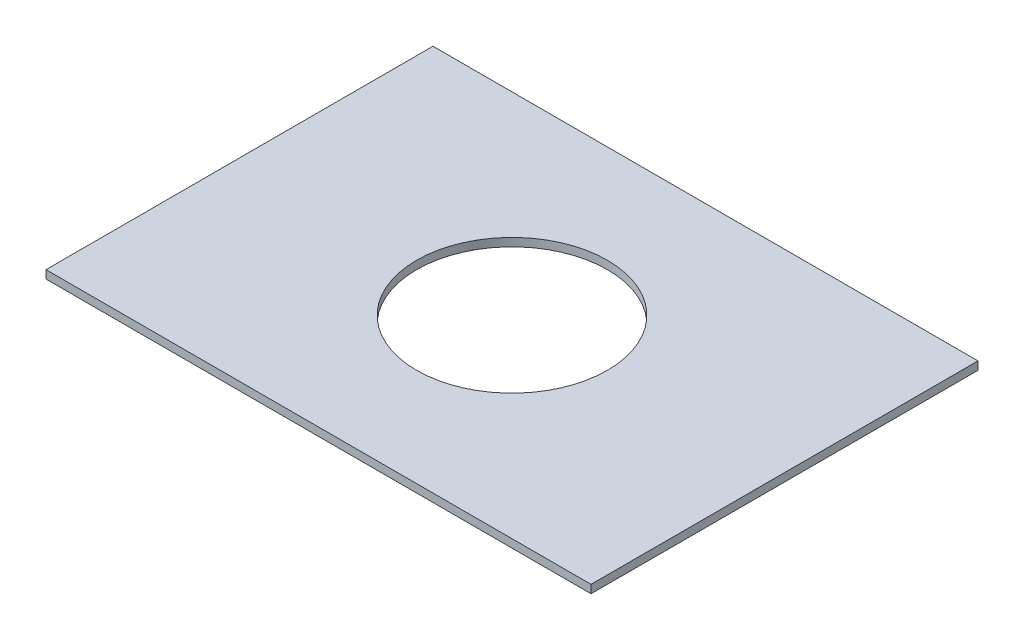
ISO-10303-21;
HEADER;
FILE_DESCRIPTION(('STEP AP214'),'2;1');
FILE_NAME('part.step','',(''),(''),'','','');
FILE_SCHEMA(('AUTOMOTIVE_DESIGN { 1 0 10303 214 1 1 1 1 }'));
ENDSEC;
DATA;
#1=APPLICATION_CONTEXT('core data for automotive mechanical design processes');
#2=APPLICATION_PROTOCOL_DEFINITION('international standard','automotive_design',2000,#1);
#3=PRODUCT_CONTEXT('',#1,'mechanical');
#4=PRODUCT('Part','Part','',(#3));
#5=PRODUCT_RELATED_PRODUCT_CATEGORY('part','',(#4));
#6=PRODUCT_DEFINITION_FORMATION('','',#4);
#7=PRODUCT_DEFINITION_CONTEXT('part definition',#1,'design');
#8=PRODUCT_DEFINITION('design','',#6,#7);
#9=PRODUCT_DEFINITION_SHAPE('','',#8);
#10=(LENGTH_UNIT() NAMED_UNIT(*) SI_UNIT(.MILLI.,.METRE.));
#11=(NAMED_UNIT(*) PLANE_ANGLE_UNIT() SI_UNIT($,.RADIAN.));
#12=(NAMED_UNIT(*) SI_UNIT($,.STERADIAN.) SOLID_ANGLE_UNIT());
#13=UNCERTAINTY_MEASURE_WITH_UNIT(LENGTH_MEASURE(1.E-05),#10,'distance_accuracy_value','');
#14=(GEOMETRIC_REPRESENTATION_CONTEXT(3) GLOBAL_UNCERTAINTY_ASSIGNED_CONTEXT((#13)) GLOBAL_UNIT_ASSIGNED_CONTEXT((#10,
#11,#12)) REPRESENTATION_CONTEXT('',''));
#15=CARTESIAN_POINT('',(0.,0.,0.));
#16=DIRECTION('',(0.,0.,1.));
#17=DIRECTION('',(1.,0.,0.));
#18=AXIS2_PLACEMENT_3D('',#15,#16,#17);
#19=CARTESIAN_POINT('',(0.,0.,0.));
#20=DIRECTION('',(0.,-1.,0.));
#21=DIRECTION('',(0.,0.,-1.));
#22=AXIS2_PLACEMENT_3D('',#19,#20,#21);
#23=PLANE('',#22);
#24=CARTESIAN_POINT('',(51.5,0.,-37.));
#25=DIRECTION('',(0.,-1.,0.));
#26=DIRECTION('',(0.,0.,-1.));
#27=AXIS2_PLACEMENT_3D('',#24,#25,#26);
#28=CIRCLE('',#27,17.5);
#29=CARTESIAN_POINT('',(51.5,0.,-54.5));
#30=VERTEX_POINT('',#29);
#31=EDGE_CURVE('E76',#30,#30,#28,.T.);
#32=ORIENTED_EDGE('',*,*,#31,.F.);
#33=EDGE_LOOP('',(#32));
#34=FACE_BOUND('',#33,.T.);
#35=DIRECTION('',(-1.,0.,0.));
#36=VECTOR('',#35,1.);
#37=CARTESIAN_POINT('',(0.,0.,-72.5));
#38=LINE('',#37,#36);
#39=CARTESIAN_POINT('',(101.5,0.,-72.5));
#40=VERTEX_POINT('',#39);
#41=CARTESIAN_POINT('',(1.5,0.,-72.5));
#42=VERTEX_POINT('',#41);
#43=EDGE_CURVE('E84',#40,#42,#38,.T.);
#44=ORIENTED_EDGE('',*,*,#43,.F.);
#45=DIRECTION('',(0.,0.,1.));
#46=VECTOR('',#45,1.);
#47=CARTESIAN_POINT('',(101.5,0.,0.));
#48=LINE('',#47,#46);
#49=CARTESIAN_POINT('',(101.5,0.,-1.5));
#50=VERTEX_POINT('',#49);
#51=EDGE_CURVE('E11',#40,#50,#48,.T.);
#52=ORIENTED_EDGE('',*,*,#51,.T.);
#53=DIRECTION('',(-1.,0.,0.));
#54=VECTOR('',#53,1.);
#55=CARTESIAN_POINT('',(0.,0.,-1.5));
#56=LINE('',#55,#54);
#57=CARTESIAN_POINT('',(1.50000000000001,0.,-1.5));
#58=VERTEX_POINT('',#57);
#59=EDGE_CURVE('E40',#50,#58,#56,.T.);
#60=ORIENTED_EDGE('',*,*,#59,.T.);
#61=DIRECTION('',(0.,0.,-1.));
#62=VECTOR('',#61,1.);
#63=CARTESIAN_POINT('',(1.50000000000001,0.,0.));
#64=LINE('',#63,#62);
#65=EDGE_CURVE('E96',#58,#42,#64,.T.);
#66=ORIENTED_EDGE('',*,*,#65,.T.);
#67=EDGE_LOOP('',(#44,#52,#60,#66));
#68=FACE_BOUND('',#67,.T.);
#69=ADVANCED_FACE('F33',(#34,#68),#23,.T.);
#70=CARTESIAN_POINT('',(101.5,-8.5,-1.5));
#71=DIRECTION('',(1.,0.,0.));
#72=DIRECTION('',(0.,0.,-1.));
#73=AXIS2_PLACEMENT_3D('',#70,#71,#72);
#74=PLANE('',#73);
#75=DIRECTION('',(0.,1.,0.));
#76=VECTOR('',#75,1.);
#77=CARTESIAN_POINT('',(101.5,-8.5,-72.5));
#78=LINE('',#77,#76);
#79=CARTESIAN_POINT('',(101.5,1.5,-72.5));
#80=VERTEX_POINT('',#79);
#81=EDGE_CURVE('E73',#40,#80,#78,.T.);
#82=ORIENTED_EDGE('',*,*,#81,.T.);
#83=DIRECTION('',(0.,0.,-1.));
#84=VECTOR('',#83,1.);
#85=CARTESIAN_POINT('',(101.5,1.5,-1.5));
#86=LINE('',#85,#84);
#87=CARTESIAN_POINT('',(101.5,1.5,-1.5));
#88=VERTEX_POINT('',#87);
#89=EDGE_CURVE('E83',#88,#80,#86,.T.);
#90=ORIENTED_EDGE('',*,*,#89,.F.);
#91=DIRECTION('',(0.,1.,0.));
#92=VECTOR('',#91,1.);
#93=CARTESIAN_POINT('',(101.5,-8.5,-1.5));
#94=LINE('',#93,#92);
#95=EDGE_CURVE('E91',#50,#88,#94,.T.);
#96=ORIENTED_EDGE('',*,*,#95,.F.);
#97=ORIENTED_EDGE('',*,*,#51,.F.);
#98=EDGE_LOOP('',(#82,#90,#96,#97));
#99=FACE_BOUND('',#98,.T.);
#100=ADVANCED_FACE('F81',(#99),#74,.T.);
#101=CARTESIAN_POINT('',(1.50000000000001,-8.5,-1.5));
#102=DIRECTION('',(0.,0.,1.));
#103=DIRECTION('',(1.,0.,0.));
#104=AXIS2_PLACEMENT_3D('',#101,#102,#103);
#105=PLANE('',#104);
#106=ORIENTED_EDGE('',*,*,#95,.T.);
#107=DIRECTION('',(1.,0.,0.));
#108=VECTOR('',#107,1.);
#109=CARTESIAN_POINT('',(1.50000000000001,1.5,-1.5));
#110=LINE('',#109,#108);
#111=CARTESIAN_POINT('',(1.50000000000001,1.5,-1.5));
#112=VERTEX_POINT('',#111);
#113=EDGE_CURVE('E87',#112,#88,#110,.T.);
#114=ORIENTED_EDGE('',*,*,#113,.F.);
#115=DIRECTION('',(0.,1.,0.));
#116=VECTOR('',#115,1.);
#117=CARTESIAN_POINT('',(1.50000000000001,-8.5,-1.5));
#118=LINE('',#117,#116);
#119=EDGE_CURVE('E88',#58,#112,#118,.T.);
#120=ORIENTED_EDGE('',*,*,#119,.F.);
#121=ORIENTED_EDGE('',*,*,#59,.F.);
#122=EDGE_LOOP('',(#106,#114,#120,#121));
#123=FACE_BOUND('',#122,.T.);
#124=ADVANCED_FACE('F104',(#123),#105,.T.);
#125=CARTESIAN_POINT('',(1.5,-8.5,-73.5));
#126=DIRECTION('',(-1.,0.,0.));
#127=DIRECTION('',(0.,0.,1.));
#128=AXIS2_PLACEMENT_3D('',#125,#126,#127);
#129=PLANE('',#128);
#130=DIRECTION('',(0.,1.,0.));
#131=VECTOR('',#130,1.);
#132=CARTESIAN_POINT('',(1.5,-8.5,-72.5));
#133=LINE('',#132,#131);
#134=CARTESIAN_POINT('',(1.5,1.5,-72.5));
#135=VERTEX_POINT('',#134);
#136=EDGE_CURVE('E47',#42,#135,#133,.T.);
#137=ORIENTED_EDGE('',*,*,#136,.F.);
#138=ORIENTED_EDGE('',*,*,#65,.F.);
#139=ORIENTED_EDGE('',*,*,#119,.T.);
#140=DIRECTION('',(0.,0.,1.));
#141=VECTOR('',#140,1.);
#142=CARTESIAN_POINT('',(1.5,1.5,-73.5));
#143=LINE('',#142,#141);
#144=EDGE_CURVE('E54',#135,#112,#143,.T.);
#145=ORIENTED_EDGE('',*,*,#144,.F.);
#146=EDGE_LOOP('',(#137,#138,#139,#145));
#147=FACE_BOUND('',#146,.T.);
#148=ADVANCED_FACE('F106',(#147),#129,.T.);
#149=CARTESIAN_POINT('',(0.,1.5,0.));
#150=DIRECTION('',(0.,-1.,0.));
#151=DIRECTION('',(0.,0.,-1.));
#152=AXIS2_PLACEMENT_3D('',#149,#150,#151);
#153=PLANE('',#152);
#154=CARTESIAN_POINT('',(51.5,1.5,-37.));
#155=DIRECTION('',(0.,1.,0.));
#156=DIRECTION('',(0.,0.,1.));
#157=AXIS2_PLACEMENT_3D('',#154,#155,#156);
#158=CIRCLE('',#157,17.5);
#159=CARTESIAN_POINT('',(51.5,1.5,-19.5));
#160=VERTEX_POINT('',#159);
#161=EDGE_CURVE('E112',#160,#160,#158,.T.);
#162=ORIENTED_EDGE('',*,*,#161,.F.);
#163=EDGE_LOOP('',(#162));
#164=FACE_BOUND('',#163,.T.);
#165=ORIENTED_EDGE('',*,*,#89,.T.);
#166=DIRECTION('',(1.,0.,0.));
#167=VECTOR('',#166,1.);
#168=CARTESIAN_POINT('',(101.5,1.5,-72.5));
#169=LINE('',#168,#167);
#170=EDGE_CURVE('E70',#135,#80,#169,.T.);
#171=ORIENTED_EDGE('',*,*,#170,.F.);
#172=ORIENTED_EDGE('',*,*,#144,.T.);
#173=ORIENTED_EDGE('',*,*,#113,.T.);
#174=EDGE_LOOP('',(#165,#171,#172,#173));
#175=FACE_BOUND('',#174,.T.);
#176=ADVANCED_FACE('F86',(#164,#175),#153,.F.);
#177=CARTESIAN_POINT('',(101.5,-8.5,-72.5));
#178=DIRECTION('',(0.,0.,1.));
#179=DIRECTION('',(1.,0.,0.));
#180=AXIS2_PLACEMENT_3D('',#177,#178,#179);
#181=PLANE('',#180);
#182=ORIENTED_EDGE('',*,*,#43,.T.);
#183=ORIENTED_EDGE('',*,*,#136,.T.);
#184=ORIENTED_EDGE('',*,*,#170,.T.);
#185=ORIENTED_EDGE('',*,*,#81,.F.);
#186=EDGE_LOOP('',(#182,#183,#184,#185));
#187=FACE_BOUND('',#186,.T.);
#188=ADVANCED_FACE('F72',(#187),#181,.F.);
#189=CARTESIAN_POINT('',(51.5,-8.5,-37.));
#190=DIRECTION('',(0.,1.,0.));
#191=DIRECTION('',(0.,0.,1.));
#192=AXIS2_PLACEMENT_3D('',#189,#190,#191);
#193=CYLINDRICAL_SURFACE('',#192,17.5);
#194=ORIENTED_EDGE('',*,*,#31,.T.);
#195=EDGE_LOOP('',(#194));
#196=FACE_BOUND('',#195,.T.);
#197=ORIENTED_EDGE('',*,*,#161,.T.);
#198=EDGE_LOOP('',(#197));
#199=FACE_BOUND('',#198,.T.);
#200=ADVANCED_FACE('F116',(#196,#199),#193,.F.);
#201=CLOSED_SHELL('',(#69,#100,#124,#148,#176,#188,#200));
#202=MANIFOLD_SOLID_BREP('B2',#201);
#203=ADVANCED_BREP_SHAPE_REPRESENTATION('',(#18,#202),#14);
#204=SHAPE_DEFINITION_REPRESENTATION(#9,#203);
ENDSEC;
END-ISO-10303-21;
